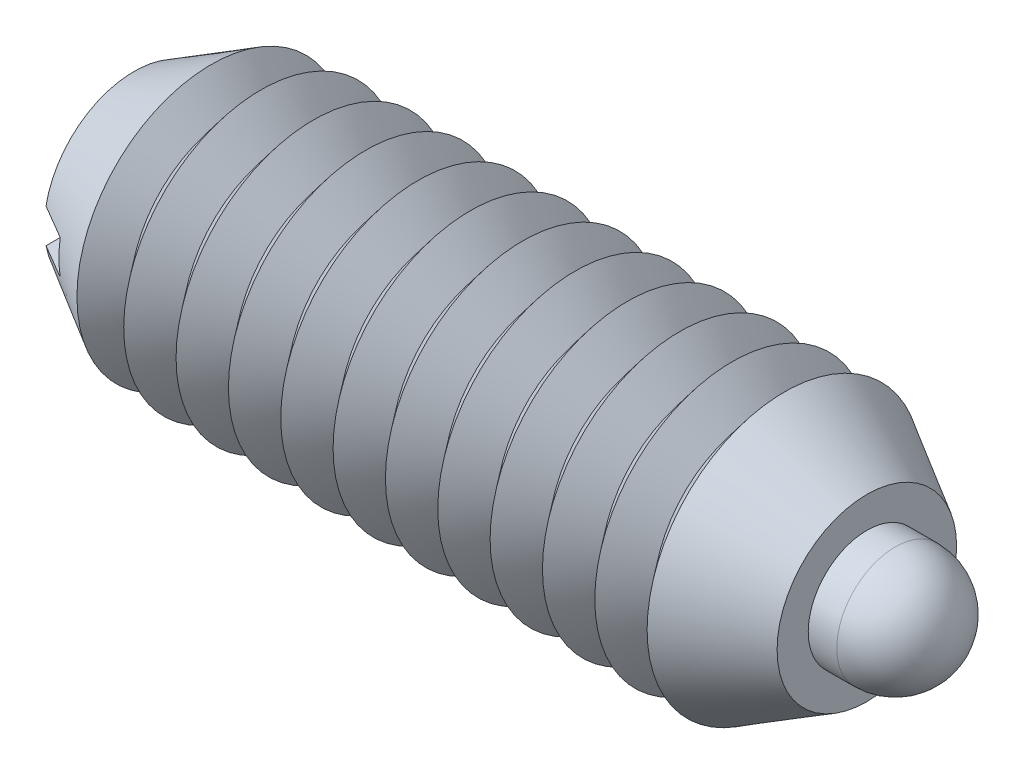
ISO-10303-21;
HEADER;
FILE_DESCRIPTION(('STEP AP214'),'2;1');
FILE_NAME('part.step','',(''),(''),'','','');
FILE_SCHEMA(('AUTOMOTIVE_DESIGN { 1 0 10303 214 1 1 1 1 }'));
ENDSEC;
DATA;
#1=APPLICATION_CONTEXT('core data for automotive mechanical design processes');
#2=APPLICATION_PROTOCOL_DEFINITION('international standard','automotive_design',2000,#1);
#3=PRODUCT_CONTEXT('',#1,'mechanical');
#4=PRODUCT('Part','Part','',(#3));
#5=PRODUCT_RELATED_PRODUCT_CATEGORY('part','',(#4));
#6=PRODUCT_DEFINITION_FORMATION('','',#4);
#7=PRODUCT_DEFINITION_CONTEXT('part definition',#1,'design');
#8=PRODUCT_DEFINITION('design','',#6,#7);
#9=PRODUCT_DEFINITION_SHAPE('','',#8);
#10=(LENGTH_UNIT() NAMED_UNIT(*) SI_UNIT(.MILLI.,.METRE.));
#11=(NAMED_UNIT(*) PLANE_ANGLE_UNIT() SI_UNIT($,.RADIAN.));
#12=(NAMED_UNIT(*) SI_UNIT($,.STERADIAN.) SOLID_ANGLE_UNIT());
#13=UNCERTAINTY_MEASURE_WITH_UNIT(LENGTH_MEASURE(1.E-05),#10,'distance_accuracy_value','');
#14=(GEOMETRIC_REPRESENTATION_CONTEXT(3) GLOBAL_UNCERTAINTY_ASSIGNED_CONTEXT((#13)) GLOBAL_UNIT_ASSIGNED_CONTEXT((#10,
#11,#12)) REPRESENTATION_CONTEXT('',''));
#15=CARTESIAN_POINT('',(0.,0.,0.));
#16=DIRECTION('',(0.,0.,1.));
#17=DIRECTION('',(1.,0.,0.));
#18=AXIS2_PLACEMENT_3D('',#15,#16,#17);
#19=CARTESIAN_POINT('',(9.0678,0.,0.));
#20=DIRECTION('',(-1.,0.,0.));
#21=DIRECTION('',(0.,-0.719424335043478,-0.694570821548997));
#22=AXIS2_PLACEMENT_3D('',#19,#20,#21);
#23=PLANE('',#22);
#24=CARTESIAN_POINT('',(9.0678,0.,0.));
#25=DIRECTION('',(1.,0.,0.));
#26=DIRECTION('',(0.,0.719424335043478,0.694570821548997));
#27=AXIS2_PLACEMENT_3D('',#24,#25,#26);
#28=CIRCLE('',#27,0.889);
#29=CARTESIAN_POINT('',(9.0678,0.639568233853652,0.617473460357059));
#30=VERTEX_POINT('',#29);
#31=EDGE_CURVE('P0_E10',#30,#30,#28,.T.);
#32=ORIENTED_EDGE('',*,*,#31,.F.);
#33=EDGE_LOOP('',(#32));
#34=FACE_BOUND('',#33,.T.);
#35=ADVANCED_FACE('P0_F14',(#34),#23,.T.);
#36=CARTESIAN_POINT('',(9.2456,0.,0.));
#37=DIRECTION('',(1.,0.,0.));
#38=DIRECTION('',(0.,0.719424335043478,0.694570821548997));
#39=AXIS2_PLACEMENT_3D('',#36,#37,#38);
#40=CONICAL_SURFACE('',#39,1.0668,0.78539816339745);
#41=ORIENTED_EDGE('',*,*,#31,.T.);
#42=EDGE_LOOP('',(#41));
#43=FACE_BOUND('',#42,.T.);
#44=CARTESIAN_POINT('',(9.2456,0.,0.));
#45=DIRECTION('',(1.,0.,0.));
#46=DIRECTION('',(0.,0.719424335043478,0.694570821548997));
#47=AXIS2_PLACEMENT_3D('',#44,#45,#46);
#48=CIRCLE('',#47,1.0668);
#49=CARTESIAN_POINT('',(9.2456,0.767481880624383,0.740968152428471));
#50=VERTEX_POINT('',#49);
#51=EDGE_CURVE('P0_E20',#50,#50,#48,.T.);
#52=ORIENTED_EDGE('',*,*,#51,.F.);
#53=EDGE_LOOP('',(#52));
#54=FACE_BOUND('',#53,.T.);
#55=ADVANCED_FACE('P0_F54',(#43,#54),#40,.T.);
#56=CARTESIAN_POINT('',(12.4333,0.,0.));
#57=DIRECTION('',(1.,0.,0.));
#58=DIRECTION('',(0.,0.719424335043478,0.694570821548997));
#59=AXIS2_PLACEMENT_3D('',#56,#57,#58);
#60=CYLINDRICAL_SURFACE('',#59,1.0668);
#61=ORIENTED_EDGE('',*,*,#51,.T.);
#62=EDGE_LOOP('',(#61));
#63=FACE_BOUND('',#62,.T.);
#64=CARTESIAN_POINT('',(10.5378413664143,0.,0.));
#65=DIRECTION('',(1.,0.,0.));
#66=DIRECTION('',(0.,0.719424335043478,0.694570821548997));
#67=AXIS2_PLACEMENT_3D('',#64,#65,#66);
#68=CIRCLE('',#67,1.0668);
#69=CARTESIAN_POINT('',(10.5378413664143,0.767481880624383,0.74096815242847));
#70=VERTEX_POINT('',#69);
#71=EDGE_CURVE('P0_E24',#70,#70,#68,.T.);
#72=ORIENTED_EDGE('',*,*,#71,.F.);
#73=EDGE_LOOP('',(#72));
#74=FACE_BOUND('',#73,.T.);
#75=ADVANCED_FACE('P0_F50',(#63,#74),#60,.T.);
#76=CARTESIAN_POINT('',(10.8458,0.,0.));
#77=DIRECTION('',(-1.,0.,0.));
#78=DIRECTION('',(0.,-0.719424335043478,-0.694570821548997));
#79=AXIS2_PLACEMENT_3D('',#76,#77,#78);
#80=CONICAL_SURFACE('',#79,0.889,0.523598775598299);
#81=ORIENTED_EDGE('',*,*,#71,.T.);
#82=EDGE_LOOP('',(#81));
#83=FACE_BOUND('',#82,.T.);
#84=CARTESIAN_POINT('',(10.8458,0.,0.));
#85=DIRECTION('',(1.,0.,0.));
#86=DIRECTION('',(0.,0.719424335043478,0.694570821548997));
#87=AXIS2_PLACEMENT_3D('',#84,#85,#86);
#88=CIRCLE('',#87,0.889);
#89=CARTESIAN_POINT('',(10.8458,0.639568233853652,0.617473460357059));
#90=VERTEX_POINT('',#89);
#91=EDGE_CURVE('P0_E28',#90,#90,#88,.T.);
#92=ORIENTED_EDGE('',*,*,#91,.F.);
#93=EDGE_LOOP('',(#92));
#94=FACE_BOUND('',#93,.T.);
#95=ADVANCED_FACE('P0_F41',(#83,#94),#80,.T.);
#96=CARTESIAN_POINT('',(12.4333,0.,0.));
#97=DIRECTION('',(1.,0.,0.));
#98=DIRECTION('',(0.,0.719424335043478,0.694570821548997));
#99=AXIS2_PLACEMENT_3D('',#96,#97,#98);
#100=CYLINDRICAL_SURFACE('',#99,0.889);
#101=ORIENTED_EDGE('',*,*,#91,.T.);
#102=EDGE_LOOP('',(#101));
#103=FACE_BOUND('',#102,.T.);
#104=CARTESIAN_POINT('',(11.5443,0.,0.));
#105=DIRECTION('',(1.,0.,0.));
#106=DIRECTION('',(0.,0.719424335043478,0.694570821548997));
#107=AXIS2_PLACEMENT_3D('',#104,#105,#106);
#108=CIRCLE('',#107,0.889);
#109=CARTESIAN_POINT('',(11.5443,0.639568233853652,0.617473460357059));
#110=VERTEX_POINT('',#109);
#111=EDGE_CURVE('P0_E33',#110,#110,#108,.T.);
#112=ORIENTED_EDGE('',*,*,#111,.F.);
#113=EDGE_LOOP('',(#112));
#114=FACE_BOUND('',#113,.T.);
#115=ADVANCED_FACE('P0_F39',(#103,#114),#100,.T.);
#116=CARTESIAN_POINT('',(11.5443,0.,0.));
#117=DIRECTION('',(1.,0.,0.));
#118=DIRECTION('',(0.,-0.719424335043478,-0.694570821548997));
#119=AXIS2_PLACEMENT_3D('',#116,#117,#118);
#120=SPHERICAL_SURFACE('',#119,0.889);
#121=ORIENTED_EDGE('',*,*,#111,.T.);
#122=EDGE_LOOP('',(#121));
#123=FACE_BOUND('',#122,.T.);
#124=ADVANCED_FACE('P0_F37',(#123),#120,.T.);
#125=CLOSED_SHELL('',(#35,#55,#75,#95,#115,#124));
#126=MANIFOLD_SOLID_BREP('P0_B1',#125);
#127=CARTESIAN_POINT('',(11.1125,0.,0.));
#128=DIRECTION('',(1.,0.,0.));
#129=DIRECTION('',(0.,0.,-1.));
#130=AXIS2_PLACEMENT_3D('',#127,#128,#129);
#131=PLANE('',#130);
#132=CARTESIAN_POINT('',(11.1125,0.,0.));
#133=DIRECTION('',(1.,0.,0.));
#134=DIRECTION('',(0.,0.,-1.));
#135=AXIS2_PLACEMENT_3D('',#132,#133,#134);
#136=CIRCLE('',#135,1.36129691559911);
#137=CARTESIAN_POINT('',(11.1125,0.,-1.36129691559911));
#138=VERTEX_POINT('',#137);
#139=EDGE_CURVE('P1_E78',#138,#138,#136,.T.);
#140=ORIENTED_EDGE('',*,*,#139,.T.);
#141=EDGE_LOOP('',(#140));
#142=FACE_BOUND('',#141,.T.);
#143=CARTESIAN_POINT('',(11.1125,0.,0.));
#144=DIRECTION('',(-1.,0.,0.));
#145=DIRECTION('',(0.,0.,1.));
#146=AXIS2_PLACEMENT_3D('',#143,#144,#145);
#147=CIRCLE('',#146,0.889);
#148=CARTESIAN_POINT('',(11.1125,0.,0.889));
#149=VERTEX_POINT('',#148);
#150=EDGE_CURVE('P1_E65',#149,#149,#147,.T.);
#151=ORIENTED_EDGE('',*,*,#150,.T.);
#152=EDGE_LOOP('',(#151));
#153=FACE_BOUND('',#152,.T.);
#154=ADVANCED_FACE('P1_F15',(#142,#153),#131,.T.);
#155=CARTESIAN_POINT('',(11.1125,0.,0.));
#156=DIRECTION('',(-1.,0.,0.));
#157=DIRECTION('',(0.,0.,1.));
#158=AXIS2_PLACEMENT_3D('',#155,#156,#157);
#159=CONICAL_SURFACE('',#158,1.36129691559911,0.523598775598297);
#160=CARTESIAN_POINT('',(9.86281999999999,0.,0.));
#161=DIRECTION('',(-1.,0.,0.));
#162=DIRECTION('',(0.,0.,1.));
#163=AXIS2_PLACEMENT_3D('',#160,#161,#162);
#164=CIRCLE('',#163,2.0828);
#165=CARTESIAN_POINT('',(9.86281999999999,0.,2.0828));
#166=VERTEX_POINT('',#165);
#167=EDGE_CURVE('P1_E127',#166,#166,#164,.T.);
#168=ORIENTED_EDGE('',*,*,#167,.F.);
#169=EDGE_LOOP('',(#168));
#170=FACE_BOUND('',#169,.T.);
#171=ORIENTED_EDGE('',*,*,#139,.F.);
#172=EDGE_LOOP('',(#171));
#173=FACE_BOUND('',#172,.T.);
#174=ADVANCED_FACE('P1_F17',(#170,#173),#159,.T.);
#175=CARTESIAN_POINT('',(0.,0.,0.));
#176=DIRECTION('',(-1.,0.,0.));
#177=DIRECTION('',(0.,0.,1.));
#178=AXIS2_PLACEMENT_3D('',#175,#176,#177);
#179=CYLINDRICAL_SURFACE('',#178,0.889);
#180=CARTESIAN_POINT('',(10.8458,0.,0.));
#181=DIRECTION('',(-1.,0.,0.));
#182=DIRECTION('',(0.,0.,1.));
#183=AXIS2_PLACEMENT_3D('',#180,#181,#182);
#184=CIRCLE('',#183,0.889);
#185=CARTESIAN_POINT('',(10.8458,0.,0.889));
#186=VERTEX_POINT('',#185);
#187=EDGE_CURVE('P1_E115',#186,#186,#184,.T.);
#188=ORIENTED_EDGE('',*,*,#187,.T.);
#189=EDGE_LOOP('',(#188));
#190=FACE_BOUND('',#189,.T.);
#191=ORIENTED_EDGE('',*,*,#150,.F.);
#192=EDGE_LOOP('',(#191));
#193=FACE_BOUND('',#192,.T.);
#194=ADVANCED_FACE('P1_F214',(#190,#193),#179,.F.);
#195=CARTESIAN_POINT('',(10.8458,0.,0.));
#196=DIRECTION('',(-1.,0.,0.));
#197=DIRECTION('',(0.,0.,1.));
#198=AXIS2_PLACEMENT_3D('',#195,#196,#197);
#199=CONICAL_SURFACE('',#198,0.889,0.78539816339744);
#200=CARTESIAN_POINT('',(10.668,0.,0.));
#201=DIRECTION('',(-1.,0.,0.));
#202=DIRECTION('',(0.,0.,1.));
#203=AXIS2_PLACEMENT_3D('',#200,#201,#202);
#204=CIRCLE('',#203,1.0668);
#205=CARTESIAN_POINT('',(10.668,0.,1.0668));
#206=VERTEX_POINT('',#205);
#207=EDGE_CURVE('P1_E118',#206,#206,#204,.T.);
#208=ORIENTED_EDGE('',*,*,#207,.T.);
#209=EDGE_LOOP('',(#208));
#210=FACE_BOUND('',#209,.T.);
#211=ORIENTED_EDGE('',*,*,#187,.F.);
#212=EDGE_LOOP('',(#211));
#213=FACE_BOUND('',#212,.T.);
#214=ADVANCED_FACE('P1_F221',(#210,#213),#199,.F.);
#215=CARTESIAN_POINT('',(0.,0.,0.));
#216=DIRECTION('',(-1.,0.,0.));
#217=DIRECTION('',(0.,0.,1.));
#218=AXIS2_PLACEMENT_3D('',#215,#216,#217);
#219=CYLINDRICAL_SURFACE('',#218,1.0668);
#220=CARTESIAN_POINT('',(1.5621,0.,0.));
#221=DIRECTION('',(-1.,0.,0.));
#222=DIRECTION('',(0.,0.,1.));
#223=AXIS2_PLACEMENT_3D('',#220,#221,#222);
#224=CIRCLE('',#223,1.0668);
#225=CARTESIAN_POINT('',(1.5621,0.,1.0668));
#226=VERTEX_POINT('',#225);
#227=EDGE_CURVE('P1_E121',#226,#226,#224,.T.);
#228=ORIENTED_EDGE('',*,*,#227,.T.);
#229=EDGE_LOOP('',(#228));
#230=FACE_BOUND('',#229,.T.);
#231=ORIENTED_EDGE('',*,*,#207,.F.);
#232=EDGE_LOOP('',(#231));
#233=FACE_BOUND('',#232,.T.);
#234=ADVANCED_FACE('P1_F226',(#230,#233),#219,.F.);
#235=CARTESIAN_POINT('',(1.5621,0.,0.));
#236=DIRECTION('',(1.,0.,0.));
#237=DIRECTION('',(0.,0.,-1.));
#238=AXIS2_PLACEMENT_3D('',#235,#236,#237);
#239=PLANE('',#238);
#240=ORIENTED_EDGE('',*,*,#227,.F.);
#241=EDGE_LOOP('',(#240));
#242=FACE_BOUND('',#241,.T.);
#243=ADVANCED_FACE('P1_F232',(#242),#239,.T.);
#244=CARTESIAN_POINT('',(9.46594499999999,0.,0.));
#245=DIRECTION('',(1.,0.,0.));
#246=DIRECTION('',(0.,0.,-1.));
#247=AXIS2_PLACEMENT_3D('',#244,#245,#246);
#248=CONICAL_SURFACE('',#247,1.58710328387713,0.895664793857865);
#249=ORIENTED_EDGE('',*,*,#167,.T.);
#250=EDGE_LOOP('',(#249));
#251=FACE_BOUND('',#250,.T.);
#252=CARTESIAN_POINT('',(9.46594499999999,0.,0.));
#253=DIRECTION('',(-1.,0.,0.));
#254=DIRECTION('',(0.,0.,1.));
#255=AXIS2_PLACEMENT_3D('',#252,#253,#254);
#256=CIRCLE('',#255,1.58710328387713);
#257=CARTESIAN_POINT('',(9.46594499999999,0.,1.58710328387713));
#258=VERTEX_POINT('',#257);
#259=EDGE_CURVE('P1_E124',#258,#258,#256,.T.);
#260=ORIENTED_EDGE('',*,*,#259,.F.);
#261=EDGE_LOOP('',(#260));
#262=FACE_BOUND('',#261,.T.);
#263=ADVANCED_FACE('P1_F236',(#251,#262),#248,.T.);
#264=CARTESIAN_POINT('',(9.06906999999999,0.,0.));
#265=DIRECTION('',(-1.,0.,0.));
#266=DIRECTION('',(0.,0.,1.));
#267=AXIS2_PLACEMENT_3D('',#264,#265,#266);
#268=CONICAL_SURFACE('',#267,2.0828,0.895664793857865);
#269=ORIENTED_EDGE('',*,*,#259,.T.);
#270=EDGE_LOOP('',(#269));
#271=FACE_BOUND('',#270,.T.);
#272=CARTESIAN_POINT('',(9.06906999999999,0.,0.));
#273=DIRECTION('',(-1.,0.,0.));
#274=DIRECTION('',(0.,0.,1.));
#275=AXIS2_PLACEMENT_3D('',#272,#273,#274);
#276=CIRCLE('',#275,2.0828);
#277=CARTESIAN_POINT('',(9.06906999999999,0.,2.0828));
#278=VERTEX_POINT('',#277);
#279=EDGE_CURVE('P1_E133',#278,#278,#276,.T.);
#280=ORIENTED_EDGE('',*,*,#279,.F.);
#281=EDGE_LOOP('',(#280));
#282=FACE_BOUND('',#281,.T.);
#283=ADVANCED_FACE('P1_F240',(#271,#282),#268,.T.);
#284=CARTESIAN_POINT('',(8.67219499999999,0.,0.));
#285=DIRECTION('',(1.,0.,0.));
#286=DIRECTION('',(0.,0.,-1.));
#287=AXIS2_PLACEMENT_3D('',#284,#285,#286);
#288=CONICAL_SURFACE('',#287,1.58710328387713,0.895664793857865);
#289=ORIENTED_EDGE('',*,*,#279,.T.);
#290=EDGE_LOOP('',(#289));
#291=FACE_BOUND('',#290,.T.);
#292=CARTESIAN_POINT('',(8.67219499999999,0.,0.));
#293=DIRECTION('',(-1.,0.,0.));
#294=DIRECTION('',(0.,0.,1.));
#295=AXIS2_PLACEMENT_3D('',#292,#293,#294);
#296=CIRCLE('',#295,1.58710328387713);
#297=CARTESIAN_POINT('',(8.67219499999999,0.,1.58710328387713));
#298=VERTEX_POINT('',#297);
#299=EDGE_CURVE('P1_E130',#298,#298,#296,.T.);
#300=ORIENTED_EDGE('',*,*,#299,.F.);
#301=EDGE_LOOP('',(#300));
#302=FACE_BOUND('',#301,.T.);
#303=ADVANCED_FACE('P1_F244',(#291,#302),#288,.T.);
#304=CARTESIAN_POINT('',(8.27532,0.,0.));
#305=DIRECTION('',(-1.,0.,0.));
#306=DIRECTION('',(0.,0.,1.));
#307=AXIS2_PLACEMENT_3D('',#304,#305,#306);
#308=CONICAL_SURFACE('',#307,2.0828,0.895664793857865);
#309=ORIENTED_EDGE('',*,*,#299,.T.);
#310=EDGE_LOOP('',(#309));
#311=FACE_BOUND('',#310,.T.);
#312=CARTESIAN_POINT('',(8.27531999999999,0.,0.));
#313=DIRECTION('',(-1.,0.,0.));
#314=DIRECTION('',(0.,0.,1.));
#315=AXIS2_PLACEMENT_3D('',#312,#313,#314);
#316=CIRCLE('',#315,2.0828);
#317=CARTESIAN_POINT('',(8.27531999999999,0.,2.0828));
#318=VERTEX_POINT('',#317);
#319=EDGE_CURVE('P1_E139',#318,#318,#316,.T.);
#320=ORIENTED_EDGE('',*,*,#319,.F.);
#321=EDGE_LOOP('',(#320));
#322=FACE_BOUND('',#321,.T.);
#323=ADVANCED_FACE('P1_F248',(#311,#322),#308,.T.);
#324=CARTESIAN_POINT('',(7.87844499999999,0.,0.));
#325=DIRECTION('',(1.,0.,0.));
#326=DIRECTION('',(0.,0.,-1.));
#327=AXIS2_PLACEMENT_3D('',#324,#325,#326);
#328=CONICAL_SURFACE('',#327,1.58710328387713,0.895664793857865);
#329=ORIENTED_EDGE('',*,*,#319,.T.);
#330=EDGE_LOOP('',(#329));
#331=FACE_BOUND('',#330,.T.);
#332=CARTESIAN_POINT('',(7.87844499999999,0.,0.));
#333=DIRECTION('',(-1.,0.,0.));
#334=DIRECTION('',(0.,0.,1.));
#335=AXIS2_PLACEMENT_3D('',#332,#333,#334);
#336=CIRCLE('',#335,1.58710328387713);
#337=CARTESIAN_POINT('',(7.87844499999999,0.,1.58710328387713));
#338=VERTEX_POINT('',#337);
#339=EDGE_CURVE('P1_E136',#338,#338,#336,.T.);
#340=ORIENTED_EDGE('',*,*,#339,.F.);
#341=EDGE_LOOP('',(#340));
#342=FACE_BOUND('',#341,.T.);
#343=ADVANCED_FACE('P1_F252',(#331,#342),#328,.T.);
#344=CARTESIAN_POINT('',(7.48156999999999,0.,0.));
#345=DIRECTION('',(-1.,0.,0.));
#346=DIRECTION('',(0.,0.,1.));
#347=AXIS2_PLACEMENT_3D('',#344,#345,#346);
#348=CONICAL_SURFACE('',#347,2.0828,0.895664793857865);
#349=ORIENTED_EDGE('',*,*,#339,.T.);
#350=EDGE_LOOP('',(#349));
#351=FACE_BOUND('',#350,.T.);
#352=CARTESIAN_POINT('',(7.48156999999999,0.,0.));
#353=DIRECTION('',(-1.,0.,0.));
#354=DIRECTION('',(0.,0.,1.));
#355=AXIS2_PLACEMENT_3D('',#352,#353,#354);
#356=CIRCLE('',#355,2.0828);
#357=CARTESIAN_POINT('',(7.48156999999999,0.,2.0828));
#358=VERTEX_POINT('',#357);
#359=EDGE_CURVE('P1_E145',#358,#358,#356,.T.);
#360=ORIENTED_EDGE('',*,*,#359,.F.);
#361=EDGE_LOOP('',(#360));
#362=FACE_BOUND('',#361,.T.);
#363=ADVANCED_FACE('P1_F256',(#351,#362),#348,.T.);
#364=CARTESIAN_POINT('',(7.08469499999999,0.,0.));
#365=DIRECTION('',(1.,0.,0.));
#366=DIRECTION('',(0.,0.,-1.));
#367=AXIS2_PLACEMENT_3D('',#364,#365,#366);
#368=CONICAL_SURFACE('',#367,1.58710328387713,0.895664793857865);
#369=ORIENTED_EDGE('',*,*,#359,.T.);
#370=EDGE_LOOP('',(#369));
#371=FACE_BOUND('',#370,.T.);
#372=CARTESIAN_POINT('',(7.08469499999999,0.,0.));
#373=DIRECTION('',(-1.,0.,0.));
#374=DIRECTION('',(0.,0.,1.));
#375=AXIS2_PLACEMENT_3D('',#372,#373,#374);
#376=CIRCLE('',#375,1.58710328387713);
#377=CARTESIAN_POINT('',(7.08469499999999,0.,1.58710328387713));
#378=VERTEX_POINT('',#377);
#379=EDGE_CURVE('P1_E142',#378,#378,#376,.T.);
#380=ORIENTED_EDGE('',*,*,#379,.F.);
#381=EDGE_LOOP('',(#380));
#382=FACE_BOUND('',#381,.T.);
#383=ADVANCED_FACE('P1_F260',(#371,#382),#368,.T.);
#384=CARTESIAN_POINT('',(6.68781999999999,0.,0.));
#385=DIRECTION('',(-1.,0.,0.));
#386=DIRECTION('',(0.,0.,1.));
#387=AXIS2_PLACEMENT_3D('',#384,#385,#386);
#388=CONICAL_SURFACE('',#387,2.0828,0.895664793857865);
#389=ORIENTED_EDGE('',*,*,#379,.T.);
#390=EDGE_LOOP('',(#389));
#391=FACE_BOUND('',#390,.T.);
#392=CARTESIAN_POINT('',(6.68781999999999,0.,0.));
#393=DIRECTION('',(-1.,0.,0.));
#394=DIRECTION('',(0.,0.,1.));
#395=AXIS2_PLACEMENT_3D('',#392,#393,#394);
#396=CIRCLE('',#395,2.0828);
#397=CARTESIAN_POINT('',(6.68781999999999,0.,2.0828));
#398=VERTEX_POINT('',#397);
#399=EDGE_CURVE('P1_E151',#398,#398,#396,.T.);
#400=ORIENTED_EDGE('',*,*,#399,.F.);
#401=EDGE_LOOP('',(#400));
#402=FACE_BOUND('',#401,.T.);
#403=ADVANCED_FACE('P1_F264',(#391,#402),#388,.T.);
#404=CARTESIAN_POINT('',(6.29094499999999,0.,0.));
#405=DIRECTION('',(1.,0.,0.));
#406=DIRECTION('',(0.,0.,-1.));
#407=AXIS2_PLACEMENT_3D('',#404,#405,#406);
#408=CONICAL_SURFACE('',#407,1.58710328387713,0.895664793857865);
#409=ORIENTED_EDGE('',*,*,#399,.T.);
#410=EDGE_LOOP('',(#409));
#411=FACE_BOUND('',#410,.T.);
#412=CARTESIAN_POINT('',(6.29094499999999,0.,0.));
#413=DIRECTION('',(-1.,0.,0.));
#414=DIRECTION('',(0.,0.,1.));
#415=AXIS2_PLACEMENT_3D('',#412,#413,#414);
#416=CIRCLE('',#415,1.58710328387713);
#417=CARTESIAN_POINT('',(6.29094499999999,0.,1.58710328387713));
#418=VERTEX_POINT('',#417);
#419=EDGE_CURVE('P1_E148',#418,#418,#416,.T.);
#420=ORIENTED_EDGE('',*,*,#419,.F.);
#421=EDGE_LOOP('',(#420));
#422=FACE_BOUND('',#421,.T.);
#423=ADVANCED_FACE('P1_F268',(#411,#422),#408,.T.);
#424=CARTESIAN_POINT('',(5.89406999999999,0.,0.));
#425=DIRECTION('',(-1.,0.,0.));
#426=DIRECTION('',(0.,0.,1.));
#427=AXIS2_PLACEMENT_3D('',#424,#425,#426);
#428=CONICAL_SURFACE('',#427,2.0828,0.895664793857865);
#429=ORIENTED_EDGE('',*,*,#419,.T.);
#430=EDGE_LOOP('',(#429));
#431=FACE_BOUND('',#430,.T.);
#432=CARTESIAN_POINT('',(5.89406999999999,0.,0.));
#433=DIRECTION('',(-1.,0.,0.));
#434=DIRECTION('',(0.,0.,1.));
#435=AXIS2_PLACEMENT_3D('',#432,#433,#434);
#436=CIRCLE('',#435,2.0828);
#437=CARTESIAN_POINT('',(5.89406999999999,0.,2.0828));
#438=VERTEX_POINT('',#437);
#439=EDGE_CURVE('P1_E157',#438,#438,#436,.T.);
#440=ORIENTED_EDGE('',*,*,#439,.F.);
#441=EDGE_LOOP('',(#440));
#442=FACE_BOUND('',#441,.T.);
#443=ADVANCED_FACE('P1_F272',(#431,#442),#428,.T.);
#444=CARTESIAN_POINT('',(5.49719499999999,0.,0.));
#445=DIRECTION('',(1.,0.,0.));
#446=DIRECTION('',(0.,0.,-1.));
#447=AXIS2_PLACEMENT_3D('',#444,#445,#446);
#448=CONICAL_SURFACE('',#447,1.58710328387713,0.895664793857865);
#449=ORIENTED_EDGE('',*,*,#439,.T.);
#450=EDGE_LOOP('',(#449));
#451=FACE_BOUND('',#450,.T.);
#452=CARTESIAN_POINT('',(5.49719499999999,0.,0.));
#453=DIRECTION('',(-1.,0.,0.));
#454=DIRECTION('',(0.,0.,1.));
#455=AXIS2_PLACEMENT_3D('',#452,#453,#454);
#456=CIRCLE('',#455,1.58710328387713);
#457=CARTESIAN_POINT('',(5.49719499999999,0.,1.58710328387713));
#458=VERTEX_POINT('',#457);
#459=EDGE_CURVE('P1_E154',#458,#458,#456,.T.);
#460=ORIENTED_EDGE('',*,*,#459,.F.);
#461=EDGE_LOOP('',(#460));
#462=FACE_BOUND('',#461,.T.);
#463=ADVANCED_FACE('P1_F276',(#451,#462),#448,.T.);
#464=CARTESIAN_POINT('',(5.10031999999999,0.,0.));
#465=DIRECTION('',(-1.,0.,0.));
#466=DIRECTION('',(0.,0.,1.));
#467=AXIS2_PLACEMENT_3D('',#464,#465,#466);
#468=CONICAL_SURFACE('',#467,2.0828,0.895664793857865);
#469=ORIENTED_EDGE('',*,*,#459,.T.);
#470=EDGE_LOOP('',(#469));
#471=FACE_BOUND('',#470,.T.);
#472=CARTESIAN_POINT('',(5.10031999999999,0.,0.));
#473=DIRECTION('',(-1.,0.,0.));
#474=DIRECTION('',(0.,0.,1.));
#475=AXIS2_PLACEMENT_3D('',#472,#473,#474);
#476=CIRCLE('',#475,2.0828);
#477=CARTESIAN_POINT('',(5.10031999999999,0.,2.0828));
#478=VERTEX_POINT('',#477);
#479=EDGE_CURVE('P1_E163',#478,#478,#476,.T.);
#480=ORIENTED_EDGE('',*,*,#479,.F.);
#481=EDGE_LOOP('',(#480));
#482=FACE_BOUND('',#481,.T.);
#483=ADVANCED_FACE('P1_F280',(#471,#482),#468,.T.);
#484=CARTESIAN_POINT('',(4.70344499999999,0.,0.));
#485=DIRECTION('',(1.,0.,0.));
#486=DIRECTION('',(0.,0.,-1.));
#487=AXIS2_PLACEMENT_3D('',#484,#485,#486);
#488=CONICAL_SURFACE('',#487,1.58710328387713,0.895664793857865);
#489=ORIENTED_EDGE('',*,*,#479,.T.);
#490=EDGE_LOOP('',(#489));
#491=FACE_BOUND('',#490,.T.);
#492=CARTESIAN_POINT('',(4.70344499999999,0.,0.));
#493=DIRECTION('',(-1.,0.,0.));
#494=DIRECTION('',(0.,0.,1.));
#495=AXIS2_PLACEMENT_3D('',#492,#493,#494);
#496=CIRCLE('',#495,1.58710328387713);
#497=CARTESIAN_POINT('',(4.70344499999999,0.,1.58710328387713));
#498=VERTEX_POINT('',#497);
#499=EDGE_CURVE('P1_E160',#498,#498,#496,.T.);
#500=ORIENTED_EDGE('',*,*,#499,.F.);
#501=EDGE_LOOP('',(#500));
#502=FACE_BOUND('',#501,.T.);
#503=ADVANCED_FACE('P1_F284',(#491,#502),#488,.T.);
#504=CARTESIAN_POINT('',(4.30657,0.,0.));
#505=DIRECTION('',(-1.,0.,0.));
#506=DIRECTION('',(0.,0.,1.));
#507=AXIS2_PLACEMENT_3D('',#504,#505,#506);
#508=CONICAL_SURFACE('',#507,2.0828,0.895664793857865);
#509=ORIENTED_EDGE('',*,*,#499,.T.);
#510=EDGE_LOOP('',(#509));
#511=FACE_BOUND('',#510,.T.);
#512=CARTESIAN_POINT('',(4.30656999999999,0.,0.));
#513=DIRECTION('',(-1.,0.,0.));
#514=DIRECTION('',(0.,0.,1.));
#515=AXIS2_PLACEMENT_3D('',#512,#513,#514);
#516=CIRCLE('',#515,2.0828);
#517=CARTESIAN_POINT('',(4.30656999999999,0.,2.0828));
#518=VERTEX_POINT('',#517);
#519=EDGE_CURVE('P1_E169',#518,#518,#516,.T.);
#520=ORIENTED_EDGE('',*,*,#519,.F.);
#521=EDGE_LOOP('',(#520));
#522=FACE_BOUND('',#521,.T.);
#523=ADVANCED_FACE('P1_F288',(#511,#522),#508,.T.);
#524=CARTESIAN_POINT('',(3.909695,0.,0.));
#525=DIRECTION('',(1.,0.,0.));
#526=DIRECTION('',(0.,0.,-1.));
#527=AXIS2_PLACEMENT_3D('',#524,#525,#526);
#528=CONICAL_SURFACE('',#527,1.58710328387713,0.895664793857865);
#529=ORIENTED_EDGE('',*,*,#519,.T.);
#530=EDGE_LOOP('',(#529));
#531=FACE_BOUND('',#530,.T.);
#532=CARTESIAN_POINT('',(3.909695,0.,0.));
#533=DIRECTION('',(-1.,0.,0.));
#534=DIRECTION('',(0.,0.,1.));
#535=AXIS2_PLACEMENT_3D('',#532,#533,#534);
#536=CIRCLE('',#535,1.58710328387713);
#537=CARTESIAN_POINT('',(3.909695,0.,1.58710328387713));
#538=VERTEX_POINT('',#537);
#539=EDGE_CURVE('P1_E166',#538,#538,#536,.T.);
#540=ORIENTED_EDGE('',*,*,#539,.F.);
#541=EDGE_LOOP('',(#540));
#542=FACE_BOUND('',#541,.T.);
#543=ADVANCED_FACE('P1_F292',(#531,#542),#528,.T.);
#544=CARTESIAN_POINT('',(3.51282,0.,0.));
#545=DIRECTION('',(-1.,0.,0.));
#546=DIRECTION('',(0.,0.,1.));
#547=AXIS2_PLACEMENT_3D('',#544,#545,#546);
#548=CONICAL_SURFACE('',#547,2.0828,0.895664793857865);
#549=ORIENTED_EDGE('',*,*,#539,.T.);
#550=EDGE_LOOP('',(#549));
#551=FACE_BOUND('',#550,.T.);
#552=CARTESIAN_POINT('',(3.51281999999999,0.,0.));
#553=DIRECTION('',(-1.,0.,0.));
#554=DIRECTION('',(0.,0.,1.));
#555=AXIS2_PLACEMENT_3D('',#552,#553,#554);
#556=CIRCLE('',#555,2.0828);
#557=CARTESIAN_POINT('',(3.51281999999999,0.,2.0828));
#558=VERTEX_POINT('',#557);
#559=EDGE_CURVE('P1_E175',#558,#558,#556,.T.);
#560=ORIENTED_EDGE('',*,*,#559,.F.);
#561=EDGE_LOOP('',(#560));
#562=FACE_BOUND('',#561,.T.);
#563=ADVANCED_FACE('P1_F296',(#551,#562),#548,.T.);
#564=CARTESIAN_POINT('',(3.115945,0.,0.));
#565=DIRECTION('',(1.,0.,0.));
#566=DIRECTION('',(0.,0.,-1.));
#567=AXIS2_PLACEMENT_3D('',#564,#565,#566);
#568=CONICAL_SURFACE('',#567,1.58710328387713,0.895664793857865);
#569=ORIENTED_EDGE('',*,*,#559,.T.);
#570=EDGE_LOOP('',(#569));
#571=FACE_BOUND('',#570,.T.);
#572=CARTESIAN_POINT('',(3.115945,0.,0.));
#573=DIRECTION('',(-1.,0.,0.));
#574=DIRECTION('',(0.,0.,1.));
#575=AXIS2_PLACEMENT_3D('',#572,#573,#574);
#576=CIRCLE('',#575,1.58710328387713);
#577=CARTESIAN_POINT('',(3.115945,0.,1.58710328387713));
#578=VERTEX_POINT('',#577);
#579=EDGE_CURVE('P1_E172',#578,#578,#576,.T.);
#580=ORIENTED_EDGE('',*,*,#579,.F.);
#581=EDGE_LOOP('',(#580));
#582=FACE_BOUND('',#581,.T.);
#583=ADVANCED_FACE('P1_F300',(#571,#582),#568,.T.);
#584=CARTESIAN_POINT('',(2.71907,0.,0.));
#585=DIRECTION('',(-1.,0.,0.));
#586=DIRECTION('',(0.,0.,1.));
#587=AXIS2_PLACEMENT_3D('',#584,#585,#586);
#588=CONICAL_SURFACE('',#587,2.0828,0.895664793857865);
#589=ORIENTED_EDGE('',*,*,#579,.T.);
#590=EDGE_LOOP('',(#589));
#591=FACE_BOUND('',#590,.T.);
#592=CARTESIAN_POINT('',(2.71906999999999,0.,0.));
#593=DIRECTION('',(-1.,0.,0.));
#594=DIRECTION('',(0.,0.,1.));
#595=AXIS2_PLACEMENT_3D('',#592,#593,#594);
#596=CIRCLE('',#595,2.0828);
#597=CARTESIAN_POINT('',(2.71906999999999,0.,2.0828));
#598=VERTEX_POINT('',#597);
#599=EDGE_CURVE('P1_E181',#598,#598,#596,.T.);
#600=ORIENTED_EDGE('',*,*,#599,.F.);
#601=EDGE_LOOP('',(#600));
#602=FACE_BOUND('',#601,.T.);
#603=ADVANCED_FACE('P1_F206',(#591,#602),#588,.T.);
#604=CARTESIAN_POINT('',(2.32219499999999,0.,0.));
#605=DIRECTION('',(1.,0.,0.));
#606=DIRECTION('',(0.,0.,-1.));
#607=AXIS2_PLACEMENT_3D('',#604,#605,#606);
#608=CONICAL_SURFACE('',#607,1.58710328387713,0.895664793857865);
#609=ORIENTED_EDGE('',*,*,#599,.T.);
#610=EDGE_LOOP('',(#609));
#611=FACE_BOUND('',#610,.T.);
#612=CARTESIAN_POINT('',(2.32219499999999,0.,0.));
#613=DIRECTION('',(-1.,0.,0.));
#614=DIRECTION('',(0.,0.,1.));
#615=AXIS2_PLACEMENT_3D('',#612,#613,#614);
#616=CIRCLE('',#615,1.58710328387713);
#617=CARTESIAN_POINT('',(2.32219499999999,0.,1.58710328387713));
#618=VERTEX_POINT('',#617);
#619=EDGE_CURVE('P1_E178',#618,#618,#616,.T.);
#620=ORIENTED_EDGE('',*,*,#619,.F.);
#621=EDGE_LOOP('',(#620));
#622=FACE_BOUND('',#621,.T.);
#623=ADVANCED_FACE('P1_F196',(#611,#622),#608,.T.);
#624=CARTESIAN_POINT('',(1.92532,0.,0.));
#625=DIRECTION('',(-1.,0.,0.));
#626=DIRECTION('',(0.,0.,1.));
#627=AXIS2_PLACEMENT_3D('',#624,#625,#626);
#628=CONICAL_SURFACE('',#627,2.0828,0.895664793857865);
#629=ORIENTED_EDGE('',*,*,#619,.T.);
#630=EDGE_LOOP('',(#629));
#631=FACE_BOUND('',#630,.T.);
#632=CARTESIAN_POINT('',(1.92531999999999,0.,0.));
#633=DIRECTION('',(-1.,0.,0.));
#634=DIRECTION('',(0.,0.,1.));
#635=AXIS2_PLACEMENT_3D('',#632,#633,#634);
#636=CIRCLE('',#635,2.0828);
#637=CARTESIAN_POINT('',(1.92531999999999,0.,2.0828));
#638=VERTEX_POINT('',#637);
#639=EDGE_CURVE('P1_E187',#638,#638,#636,.T.);
#640=ORIENTED_EDGE('',*,*,#639,.F.);
#641=EDGE_LOOP('',(#640));
#642=FACE_BOUND('',#641,.T.);
#643=ADVANCED_FACE('P1_F194',(#631,#642),#628,.T.);
#644=CARTESIAN_POINT('',(1.52844499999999,0.,0.));
#645=DIRECTION('',(1.,0.,0.));
#646=DIRECTION('',(0.,0.,-1.));
#647=AXIS2_PLACEMENT_3D('',#644,#645,#646);
#648=CONICAL_SURFACE('',#647,1.58710328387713,0.895664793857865);
#649=ORIENTED_EDGE('',*,*,#639,.T.);
#650=EDGE_LOOP('',(#649));
#651=FACE_BOUND('',#650,.T.);
#652=CARTESIAN_POINT('',(1.52844499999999,0.,0.));
#653=DIRECTION('',(-1.,0.,0.));
#654=DIRECTION('',(0.,0.,1.));
#655=AXIS2_PLACEMENT_3D('',#652,#653,#654);
#656=CIRCLE('',#655,1.58710328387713);
#657=CARTESIAN_POINT('',(1.52844499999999,0.,1.58710328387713));
#658=VERTEX_POINT('',#657);
#659=EDGE_CURVE('P1_E184',#658,#658,#656,.T.);
#660=ORIENTED_EDGE('',*,*,#659,.F.);
#661=EDGE_LOOP('',(#660));
#662=FACE_BOUND('',#661,.T.);
#663=ADVANCED_FACE('P1_F191',(#651,#662),#648,.T.);
#664=CARTESIAN_POINT('',(1.13156999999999,0.,0.));
#665=DIRECTION('',(-1.,0.,0.));
#666=DIRECTION('',(0.,0.,1.));
#667=AXIS2_PLACEMENT_3D('',#664,#665,#666);
#668=CONICAL_SURFACE('',#667,2.0828,0.895664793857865);
#669=CARTESIAN_POINT('',(1.1689072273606,0.,0.));
#670=DIRECTION('',(-1.,0.,0.));
#671=DIRECTION('',(0.,0.,1.));
#672=AXIS2_PLACEMENT_3D('',#669,#670,#671);
#673=CIRCLE('',#672,2.03616581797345);
#674=CARTESIAN_POINT('',(1.1689072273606,0.,2.03616581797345));
#675=VERTEX_POINT('',#674);
#676=EDGE_CURVE('P1_E19',#675,#675,#673,.T.);
#677=ORIENTED_EDGE('',*,*,#676,.F.);
#678=EDGE_LOOP('',(#677));
#679=FACE_BOUND('',#678,.T.);
#680=ORIENTED_EDGE('',*,*,#659,.T.);
#681=EDGE_LOOP('',(#680));
#682=FACE_BOUND('',#681,.T.);
#683=ADVANCED_FACE('P1_F204',(#679,#682),#668,.T.);
#684=CARTESIAN_POINT('',(0.,0.,0.));
#685=DIRECTION('',(1.,0.,0.));
#686=DIRECTION('',(0.,0.,-1.));
#687=AXIS2_PLACEMENT_3D('',#684,#685,#686);
#688=PLANE('',#687);
#689=CARTESIAN_POINT('',(0.,0.,0.));
#690=DIRECTION('',(1.,0.,0.));
#691=DIRECTION('',(0.,0.,-1.));
#692=AXIS2_PLACEMENT_3D('',#689,#690,#691);
#693=CIRCLE('',#692,1.36129691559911);
#694=CARTESIAN_POINT('',(0.,-0.26035,-1.33616884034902));
#695=VERTEX_POINT('',#694);
#696=CARTESIAN_POINT('',(0.,-0.26035,1.33616884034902));
#697=VERTEX_POINT('',#696);
#698=EDGE_CURVE('P1_E74',#695,#697,#693,.F.);
#699=ORIENTED_EDGE('',*,*,#698,.T.);
#700=DIRECTION('',(0.,0.,1.));
#701=VECTOR('',#700,1.);
#702=CARTESIAN_POINT('',(0.,-0.26035,-2.0828));
#703=LINE('',#702,#701);
#704=EDGE_CURVE('P1_E32',#695,#697,#703,.T.);
#705=ORIENTED_EDGE('',*,*,#704,.F.);
#706=EDGE_LOOP('',(#699,#705));
#707=FACE_BOUND('',#706,.T.);
#708=ADVANCED_FACE('P1_F100',(#707),#688,.F.);
#709=CARTESIAN_POINT('',(0.,-0.26035,-2.0828));
#710=DIRECTION('',(0.,-1.,0.));
#711=DIRECTION('',(0.,0.,-1.));
#712=AXIS2_PLACEMENT_3D('',#709,#710,#711);
#713=PLANE('',#712);
#714=CARTESIAN_POINT('',(3.03971056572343,-0.26035,-3.10538007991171));
#715=CARTESIAN_POINT('',(2.73619356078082,-0.26035,-2.9295030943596));
#716=CARTESIAN_POINT('',(2.43269972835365,-0.26035,-2.75358610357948));
#717=CARTESIAN_POINT('',(1.82581746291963,-0.26035,-2.40143298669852));
#718=CARTESIAN_POINT('',(1.52242906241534,-0.26035,-2.22519680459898));
#719=CARTESIAN_POINT('',(0.923841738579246,-0.26035,-1.87683600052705));
#720=CARTESIAN_POINT('',(0.628635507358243,-0.26035,-1.70472396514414));
#721=CARTESIAN_POINT('',(0.186359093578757,-0.26035,-1.44570325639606));
#722=CARTESIAN_POINT('',(0.0390349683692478,-0.26035,-1.35922831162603));
#723=CARTESIAN_POINT('',(-0.255316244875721,-0.26035,-1.18577470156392));
#724=CARTESIAN_POINT('',(-0.402343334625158,-0.26035,-1.0987960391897));
#725=CARTESIAN_POINT('',(-0.622839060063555,-0.26035,-0.967335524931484));
#726=CARTESIAN_POINT('',(-0.696530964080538,-0.26035,-0.923228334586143));
#727=CARTESIAN_POINT('',(-0.843706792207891,-0.26035,-0.834610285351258));
#728=CARTESIAN_POINT('',(-0.91719063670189,-0.26035,-0.790099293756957));
#729=CARTESIAN_POINT('',(-1.06453357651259,-0.26035,-0.699987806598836));
#730=CARTESIAN_POINT('',(-1.13838868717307,-0.26035,-0.654380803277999));
#731=CARTESIAN_POINT('',(-1.28534608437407,-0.26035,-0.562114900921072));
#732=CARTESIAN_POINT('',(-1.35844905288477,-0.26035,-0.51545710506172));
#733=CARTESIAN_POINT('',(-1.46699058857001,-0.26035,-0.44371439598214));
#734=CARTESIAN_POINT('',(-1.50300072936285,-0.26035,-0.419496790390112));
#735=CARTESIAN_POINT('',(-1.57449047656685,-0.26035,-0.370070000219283));
#736=CARTESIAN_POINT('',(-1.60996835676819,-0.26035,-0.344858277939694));
#737=CARTESIAN_POINT('',(-1.66212735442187,-0.26035,-0.305972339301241));
#738=CARTESIAN_POINT('',(-1.67925518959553,-0.26035,-0.292899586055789));
#739=CARTESIAN_POINT('',(-1.71308292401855,-0.26035,-0.266214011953));
#740=CARTESIAN_POINT('',(-1.72978291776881,-0.26035,-0.252601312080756));
#741=CARTESIAN_POINT('',(-1.76246737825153,-0.26035,-0.224673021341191));
#742=CARTESIAN_POINT('',(-1.77845456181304,-0.26035,-0.210360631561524));
#743=CARTESIAN_POINT('',(-1.8093682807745,-0.26035,-0.180644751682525));
#744=CARTESIAN_POINT('',(-1.82429647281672,-0.26035,-0.165243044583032));
#745=CARTESIAN_POINT('',(-1.84830527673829,-0.26035,-0.137332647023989));
#746=CARTESIAN_POINT('',(-1.85784954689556,-0.26035,-0.12522888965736));
#747=CARTESIAN_POINT('',(-1.87526950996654,-0.26035,-0.0998803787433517));
#748=CARTESIAN_POINT('',(-1.88315152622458,-0.26035,-0.0866402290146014));
#749=CARTESIAN_POINT('',(-1.89362009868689,-0.26035,-0.0641663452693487));
#750=CARTESIAN_POINT('',(-1.89707777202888,-0.26035,-0.0553472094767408));
#751=CARTESIAN_POINT('',(-1.90255870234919,-0.26035,-0.0372693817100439));
#752=CARTESIAN_POINT('',(-1.90458387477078,-0.26035,-0.0280112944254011));
#753=CARTESIAN_POINT('',(-1.90690933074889,-0.26035,-0.0091896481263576));
#754=CARTESIAN_POINT('',(-1.90719465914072,-0.26035,0.000375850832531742));
#755=CARTESIAN_POINT('',(-1.90594810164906,-0.26035,0.0193849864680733));
#756=CARTESIAN_POINT('',(-1.904415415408,-0.26035,0.0288285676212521));
#757=CARTESIAN_POINT('',(-1.89930080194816,-0.26035,0.0492465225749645));
#758=CARTESIAN_POINT('',(-1.89535686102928,-0.26035,0.0601271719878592));
#759=CARTESIAN_POINT('',(-1.88583002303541,-0.26035,0.0811465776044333));
#760=CARTESIAN_POINT('',(-1.88024216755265,-0.26035,0.0912829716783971));
#761=CARTESIAN_POINT('',(-1.86616017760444,-0.26035,0.113752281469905));
#762=CARTESIAN_POINT('',(-1.85729534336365,-0.26035,0.12584751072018));
#763=CARTESIAN_POINT('',(-1.83844868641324,-0.26035,0.14914656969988));
#764=CARTESIAN_POINT('',(-1.8284644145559,-0.26035,0.160348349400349));
#765=CARTESIAN_POINT('',(-1.80771838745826,-0.26035,0.182146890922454));
#766=CARTESIAN_POINT('',(-1.79695173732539,-0.26035,0.192738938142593));
#767=CARTESIAN_POINT('',(-1.77494825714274,-0.26035,0.213391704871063));
#768=CARTESIAN_POINT('',(-1.76371196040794,-0.26035,0.223452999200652));
#769=CARTESIAN_POINT('',(-1.72699655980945,-0.26035,0.255225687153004));
#770=CARTESIAN_POINT('',(-1.70086338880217,-0.26035,0.276176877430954));
#771=CARTESIAN_POINT('',(-1.64774249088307,-0.26035,0.316973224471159));
#772=CARTESIAN_POINT('',(-1.6207542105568,-0.26035,0.336817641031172));
#773=CARTESIAN_POINT('',(-1.56621112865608,-0.26035,0.375819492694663));
#774=CARTESIAN_POINT('',(-1.53865536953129,-0.26035,0.394975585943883));
#775=CARTESIAN_POINT('',(-1.48320590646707,-0.26035,0.43279358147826));
#776=CARTESIAN_POINT('',(-1.45531217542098,-0.26035,0.451455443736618));
#777=CARTESIAN_POINT('',(-1.37141571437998,-0.26035,0.506836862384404));
#778=CARTESIAN_POINT('',(-1.3150724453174,-0.26035,0.543039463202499));
#779=CARTESIAN_POINT('',(-1.20196774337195,-0.26035,0.614629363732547));
#780=CARTESIAN_POINT('',(-1.14520688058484,-0.26035,0.650017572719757));
#781=CARTESIAN_POINT('',(-0.975156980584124,-0.26035,0.755060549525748));
#782=CARTESIAN_POINT('',(-0.861438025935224,-0.26035,0.824018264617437));
#783=CARTESIAN_POINT('',(-0.633489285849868,-0.26035,0.961087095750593));
#784=CARTESIAN_POINT('',(-0.51925948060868,-0.26035,1.02919817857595));
#785=CARTESIAN_POINT('',(-0.290453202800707,-0.26035,1.16497012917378));
#786=CARTESIAN_POINT('',(-0.175876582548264,-0.26035,1.23263074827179));
#787=CARTESIAN_POINT('',(0.0534476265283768,-0.26035,1.36765677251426));
#788=CARTESIAN_POINT('',(0.168195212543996,-0.26035,1.43502218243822));
#789=CARTESIAN_POINT('',(0.512461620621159,-0.26035,1.63675212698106));
#790=CARTESIAN_POINT('',(0.742145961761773,-0.26035,1.77083413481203));
#791=CARTESIAN_POINT('',(1.20169275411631,-0.26035,2.03861386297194));
#792=CARTESIAN_POINT('',(1.43155517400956,-0.26035,2.17231163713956));
#793=CARTESIAN_POINT('',(1.77626909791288,-0.26035,2.37259626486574));
#794=CARTESIAN_POINT('',(1.89107369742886,-0.26035,2.43926383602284));
#795=CARTESIAN_POINT('',(2.12071173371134,-0.26035,2.57255910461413));
#796=CARTESIAN_POINT('',(2.23554517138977,-0.26035,2.63918680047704));
#797=CARTESIAN_POINT('',(2.46526042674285,-0.26035,2.77242550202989));
#798=CARTESIAN_POINT('',(2.58014224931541,-0.26035,2.83903649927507));
#799=CARTESIAN_POINT('',(2.80991750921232,-0.26035,2.97222858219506));
#800=CARTESIAN_POINT('',(2.92481094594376,-0.26035,3.03880966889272));
#801=CARTESIAN_POINT('',(3.03971056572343,-0.26035,3.10538007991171));
#802=B_SPLINE_CURVE_WITH_KNOTS('',3,(#714,#715,#716,#717,#718,#719,#720,#721,#722,#723,#724,
#725,#726,#727,#728,#729,#730,#731,#732,#733,#734,#735,#736,#737,#738,#739,#740,#741,#742,#743,
#744,#745,#746,#747,#748,#749,#750,#751,#752,#753,#754,#755,#756,#757,#758,#759,#760,#761,#762,
#763,#764,#765,#766,#767,#768,#769,#770,#771,#772,#773,#774,#775,#776,#777,#778,#779,#780,#781,
#782,#783,#784,#785,#786,#787,#788,#789,#790,#791,#792,#793,#794,#795,#796,#797,#798,#799,#800,
#801),.UNSPECIFIED.,.F.,.F.,(4,2,2,2,2,2,2,2,2,2,2,2,2,2,2,2,2,2,2,2,2,2,2,2,2,2,2,2,2,2,2,2,2,
2,2,2,2,2,2,2,2,2,2,4),(0.,1.05237703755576,2.10496120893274,3.13010514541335,3.64258983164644,
4.15507155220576,4.41272093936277,4.67045831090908,4.93086252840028,5.19100504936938,
5.32118736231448,5.45172676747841,5.51635986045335,5.58097855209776,5.64532514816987,
5.7095687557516,5.75574056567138,5.80173343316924,5.83005964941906,5.85834791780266,
5.88687900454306,5.91542265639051,5.9499455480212,5.98457365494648,6.02944937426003,
6.07442526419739,6.11971188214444,6.1649484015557,6.26536678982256,6.36585155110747,
6.46652260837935,6.56720179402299,6.76810239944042,6.96876659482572,7.3677344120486,
7.76671783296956,8.16590577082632,8.5650872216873,9.3629558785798,10.16070667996,
10.5589803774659,10.9572688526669,11.3556577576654,11.7540318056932),.UNSPECIFIED.);
#803=CARTESIAN_POINT('',(0.5207,-0.26035,-1.64140385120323));
#804=VERTEX_POINT('',#803);
#805=EDGE_CURVE('P1_E91',#804,#695,#802,.T.);
#806=ORIENTED_EDGE('',*,*,#805,.T.);
#807=ORIENTED_EDGE('',*,*,#704,.T.);
#808=CARTESIAN_POINT('',(0.5207,-0.26035,1.64140385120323));
#809=VERTEX_POINT('',#808);
#810=EDGE_CURVE('P1_E85',#697,#809,#802,.T.);
#811=ORIENTED_EDGE('',*,*,#810,.T.);
#812=DIRECTION('',(0.,0.,1.));
#813=VECTOR('',#812,1.);
#814=CARTESIAN_POINT('',(0.5207,-0.26035,-2.0828));
#815=LINE('',#814,#813);
#816=EDGE_CURVE('P1_E79',#804,#809,#815,.T.);
#817=ORIENTED_EDGE('',*,*,#816,.F.);
#818=EDGE_LOOP('',(#806,#807,#811,#817));
#819=FACE_BOUND('',#818,.T.);
#820=ADVANCED_FACE('P1_F94',(#819),#713,.F.);
#821=CARTESIAN_POINT('',(0.5207,0.26035,-2.0828));
#822=DIRECTION('',(1.,0.,0.));
#823=DIRECTION('',(0.,0.,-1.));
#824=AXIS2_PLACEMENT_3D('',#821,#822,#823);
#825=PLANE('',#824);
#826=CARTESIAN_POINT('',(0.5207,0.,0.));
#827=DIRECTION('',(1.,0.,0.));
#828=DIRECTION('',(0.,0.,-1.));
#829=AXIS2_PLACEMENT_3D('',#826,#827,#828);
#830=CIRCLE('',#829,1.66192320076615);
#831=CARTESIAN_POINT('',(0.5207,0.26035,1.64140385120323));
#832=VERTEX_POINT('',#831);
#833=EDGE_CURVE('P1_E40',#809,#832,#830,.F.);
#834=ORIENTED_EDGE('',*,*,#833,.T.);
#835=DIRECTION('',(0.,0.,1.));
#836=VECTOR('',#835,1.);
#837=CARTESIAN_POINT('',(0.5207,0.26035,-2.0828));
#838=LINE('',#837,#836);
#839=CARTESIAN_POINT('',(0.5207,0.26035,-1.64140385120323));
#840=VERTEX_POINT('',#839);
#841=EDGE_CURVE('P1_E75',#840,#832,#838,.T.);
#842=ORIENTED_EDGE('',*,*,#841,.F.);
#843=EDGE_CURVE('P1_E24',#840,#804,#830,.F.);
#844=ORIENTED_EDGE('',*,*,#843,.T.);
#845=ORIENTED_EDGE('',*,*,#816,.T.);
#846=EDGE_LOOP('',(#834,#842,#844,#845));
#847=FACE_BOUND('',#846,.T.);
#848=ADVANCED_FACE('P1_F99',(#847),#825,.F.);
#849=CARTESIAN_POINT('',(0.,0.26035,1.33616884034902));
#850=VERTEX_POINT('',#849);
#851=CARTESIAN_POINT('',(0.,0.26035,-1.33616884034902));
#852=VERTEX_POINT('',#851);
#853=EDGE_CURVE('P1_E71',#850,#852,#693,.F.);
#854=ORIENTED_EDGE('',*,*,#853,.T.);
#855=DIRECTION('',(0.,0.,1.));
#856=VECTOR('',#855,1.);
#857=CARTESIAN_POINT('',(0.,0.26035,-2.0828));
#858=LINE('',#857,#856);
#859=EDGE_CURVE('P1_E58',#852,#850,#858,.T.);
#860=ORIENTED_EDGE('',*,*,#859,.T.);
#861=EDGE_LOOP('',(#854,#860));
#862=FACE_BOUND('',#861,.T.);
#863=ADVANCED_FACE('P1_F73',(#862),#688,.F.);
#864=CARTESIAN_POINT('',(0.,0.26035,-2.0828));
#865=DIRECTION('',(0.,1.,0.));
#866=DIRECTION('',(0.,0.,1.));
#867=AXIS2_PLACEMENT_3D('',#864,#865,#866);
#868=PLANE('',#867);
#869=CARTESIAN_POINT('',(3.03971056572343,0.26035,3.10538007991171));
#870=CARTESIAN_POINT('',(2.73619356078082,0.26035,2.9295030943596));
#871=CARTESIAN_POINT('',(2.43269972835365,0.26035,2.75358610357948));
#872=CARTESIAN_POINT('',(1.82581746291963,0.26035,2.40143298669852));
#873=CARTESIAN_POINT('',(1.52242906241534,0.26035,2.22519680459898));
#874=CARTESIAN_POINT('',(0.923841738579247,0.26035,1.87683600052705));
#875=CARTESIAN_POINT('',(0.628635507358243,0.26035,1.70472396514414));
#876=CARTESIAN_POINT('',(0.186359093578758,0.26035,1.44570325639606));
#877=CARTESIAN_POINT('',(0.0390349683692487,0.26035,1.35922831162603));
#878=CARTESIAN_POINT('',(-0.25531624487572,0.26035,1.18577470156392));
#879=CARTESIAN_POINT('',(-0.402343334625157,0.26035,1.0987960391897));
#880=CARTESIAN_POINT('',(-0.622839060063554,0.26035,0.967335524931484));
#881=CARTESIAN_POINT('',(-0.696530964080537,0.26035,0.923228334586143));
#882=CARTESIAN_POINT('',(-0.84370679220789,0.26035,0.834610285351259));
#883=CARTESIAN_POINT('',(-0.917190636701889,0.26035,0.790099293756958));
#884=CARTESIAN_POINT('',(-1.06453357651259,0.26035,0.699987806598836));
#885=CARTESIAN_POINT('',(-1.13838868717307,0.26035,0.654380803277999));
#886=CARTESIAN_POINT('',(-1.28534608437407,0.26035,0.562114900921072));
#887=CARTESIAN_POINT('',(-1.35844905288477,0.26035,0.51545710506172));
#888=CARTESIAN_POINT('',(-1.46699058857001,0.26035,0.44371439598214));
#889=CARTESIAN_POINT('',(-1.50300072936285,0.26035,0.419496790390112));
#890=CARTESIAN_POINT('',(-1.57449047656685,0.26035,0.370070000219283));
#891=CARTESIAN_POINT('',(-1.60996835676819,0.26035,0.344858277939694));
#892=CARTESIAN_POINT('',(-1.66212735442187,0.26035,0.305972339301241));
#893=CARTESIAN_POINT('',(-1.67925518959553,0.26035,0.292899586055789));
#894=CARTESIAN_POINT('',(-1.71308292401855,0.26035,0.266214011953));
#895=CARTESIAN_POINT('',(-1.72978291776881,0.26035,0.252601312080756));
#896=CARTESIAN_POINT('',(-1.76246737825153,0.26035,0.22467302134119));
#897=CARTESIAN_POINT('',(-1.77845456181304,0.26035,0.210360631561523));
#898=CARTESIAN_POINT('',(-1.8093682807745,0.26035,0.180644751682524));
#899=CARTESIAN_POINT('',(-1.82429647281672,0.26035,0.165243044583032));
#900=CARTESIAN_POINT('',(-1.84830527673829,0.26035,0.137332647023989));
#901=CARTESIAN_POINT('',(-1.85784954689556,0.26035,0.12522888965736));
#902=CARTESIAN_POINT('',(-1.87526950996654,0.26035,0.0998803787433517));
#903=CARTESIAN_POINT('',(-1.88315152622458,0.26035,0.0866402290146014));
#904=CARTESIAN_POINT('',(-1.89362009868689,0.26035,0.0641663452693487));
#905=CARTESIAN_POINT('',(-1.89707777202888,0.26035,0.0553472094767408));
#906=CARTESIAN_POINT('',(-1.90255870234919,0.26035,0.0372693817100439));
#907=CARTESIAN_POINT('',(-1.90458387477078,0.26035,0.0280112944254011));
#908=CARTESIAN_POINT('',(-1.90690933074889,0.26035,0.0091896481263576));
#909=CARTESIAN_POINT('',(-1.90719465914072,0.26035,-0.000375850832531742));
#910=CARTESIAN_POINT('',(-1.90594810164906,0.26035,-0.0193849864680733));
#911=CARTESIAN_POINT('',(-1.904415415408,0.26035,-0.0288285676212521));
#912=CARTESIAN_POINT('',(-1.89930080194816,0.26035,-0.0492465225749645));
#913=CARTESIAN_POINT('',(-1.89535686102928,0.26035,-0.0601271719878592));
#914=CARTESIAN_POINT('',(-1.88583002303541,0.26035,-0.0811465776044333));
#915=CARTESIAN_POINT('',(-1.88024216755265,0.26035,-0.0912829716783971));
#916=CARTESIAN_POINT('',(-1.86616017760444,0.26035,-0.113752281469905));
#917=CARTESIAN_POINT('',(-1.85729534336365,0.26035,-0.12584751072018));
#918=CARTESIAN_POINT('',(-1.83844868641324,0.26035,-0.14914656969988));
#919=CARTESIAN_POINT('',(-1.8284644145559,0.26035,-0.160348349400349));
#920=CARTESIAN_POINT('',(-1.80771838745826,0.26035,-0.182146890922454));
#921=CARTESIAN_POINT('',(-1.79695173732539,0.26035,-0.192738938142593));
#922=CARTESIAN_POINT('',(-1.77494825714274,0.26035,-0.213391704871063));
#923=CARTESIAN_POINT('',(-1.76371196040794,0.26035,-0.223452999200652));
#924=CARTESIAN_POINT('',(-1.72699655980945,0.26035,-0.255225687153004));
#925=CARTESIAN_POINT('',(-1.70086338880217,0.26035,-0.276176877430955));
#926=CARTESIAN_POINT('',(-1.64774249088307,0.26035,-0.316973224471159));
#927=CARTESIAN_POINT('',(-1.6207542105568,0.26035,-0.336817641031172));
#928=CARTESIAN_POINT('',(-1.56621112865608,0.26035,-0.375819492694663));
#929=CARTESIAN_POINT('',(-1.53865536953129,0.26035,-0.394975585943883));
#930=CARTESIAN_POINT('',(-1.48320590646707,0.26035,-0.43279358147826));
#931=CARTESIAN_POINT('',(-1.45531217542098,0.26035,-0.451455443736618));
#932=CARTESIAN_POINT('',(-1.37141571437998,0.26035,-0.506836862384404));
#933=CARTESIAN_POINT('',(-1.3150724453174,0.26035,-0.543039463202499));
#934=CARTESIAN_POINT('',(-1.20196774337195,0.26035,-0.614629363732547));
#935=CARTESIAN_POINT('',(-1.14520688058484,0.26035,-0.650017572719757));
#936=CARTESIAN_POINT('',(-0.975156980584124,0.26035,-0.755060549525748));
#937=CARTESIAN_POINT('',(-0.861438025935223,0.26035,-0.824018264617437));
#938=CARTESIAN_POINT('',(-0.633489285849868,0.26035,-0.961087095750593));
#939=CARTESIAN_POINT('',(-0.51925948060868,0.26035,-1.02919817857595));
#940=CARTESIAN_POINT('',(-0.290453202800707,0.26035,-1.16497012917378));
#941=CARTESIAN_POINT('',(-0.175876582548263,0.26035,-1.23263074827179));
#942=CARTESIAN_POINT('',(0.0534476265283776,0.26035,-1.36765677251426));
#943=CARTESIAN_POINT('',(0.168195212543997,0.26035,-1.43502218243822));
#944=CARTESIAN_POINT('',(0.512461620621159,0.26035,-1.63675212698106));
#945=CARTESIAN_POINT('',(0.742145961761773,0.26035,-1.77083413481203));
#946=CARTESIAN_POINT('',(1.20169275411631,0.26035,-2.03861386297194));
#947=CARTESIAN_POINT('',(1.43155517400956,0.26035,-2.17231163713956));
#948=CARTESIAN_POINT('',(1.77626909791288,0.26035,-2.37259626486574));
#949=CARTESIAN_POINT('',(1.89107369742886,0.26035,-2.43926383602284));
#950=CARTESIAN_POINT('',(2.12071173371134,0.26035,-2.57255910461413));
#951=CARTESIAN_POINT('',(2.23554517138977,0.26035,-2.63918680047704));
#952=CARTESIAN_POINT('',(2.46526042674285,0.26035,-2.77242550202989));
#953=CARTESIAN_POINT('',(2.58014224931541,0.26035,-2.83903649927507));
#954=CARTESIAN_POINT('',(2.80991750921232,0.26035,-2.97222858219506));
#955=CARTESIAN_POINT('',(2.92481094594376,0.26035,-3.03880966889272));
#956=CARTESIAN_POINT('',(3.03971056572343,0.26035,-3.10538007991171));
#957=B_SPLINE_CURVE_WITH_KNOTS('',3,(#869,#870,#871,#872,#873,#874,#875,#876,#877,#878,#879,
#880,#881,#882,#883,#884,#885,#886,#887,#888,#889,#890,#891,#892,#893,#894,#895,#896,#897,#898,
#899,#900,#901,#902,#903,#904,#905,#906,#907,#908,#909,#910,#911,#912,#913,#914,#915,#916,#917,
#918,#919,#920,#921,#922,#923,#924,#925,#926,#927,#928,#929,#930,#931,#932,#933,#934,#935,#936,
#937,#938,#939,#940,#941,#942,#943,#944,#945,#946,#947,#948,#949,#950,#951,#952,#953,#954,#955,
#956),.UNSPECIFIED.,.F.,.F.,(4,2,2,2,2,2,2,2,2,2,2,2,2,2,2,2,2,2,2,2,2,2,2,2,2,2,2,2,2,2,2,2,2,
2,2,2,2,2,2,2,2,2,2,4),(0.,1.05237703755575,2.10496120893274,3.13010514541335,3.64258983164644,
4.15507155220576,4.41272093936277,4.67045831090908,4.93086252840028,5.19100504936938,
5.32118736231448,5.45172676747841,5.51635986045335,5.58097855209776,5.64532514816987,
5.7095687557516,5.75574056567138,5.80173343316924,5.83005964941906,5.85834791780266,
5.88687900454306,5.91542265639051,5.9499455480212,5.98457365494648,6.02944937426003,
6.07442526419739,6.11971188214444,6.1649484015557,6.26536678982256,6.36585155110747,
6.46652260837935,6.56720179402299,6.76810239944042,6.96876659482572,7.3677344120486,
7.76671783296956,8.16590577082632,8.56508722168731,9.3629558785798,10.16070667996,
10.5589803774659,10.9572688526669,11.3556577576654,11.7540318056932),.UNSPECIFIED.);
#958=EDGE_CURVE('P1_E25',#832,#850,#957,.T.);
#959=ORIENTED_EDGE('',*,*,#958,.T.);
#960=ORIENTED_EDGE('',*,*,#859,.F.);
#961=EDGE_CURVE('P1_E10',#852,#840,#957,.T.);
#962=ORIENTED_EDGE('',*,*,#961,.T.);
#963=ORIENTED_EDGE('',*,*,#841,.T.);
#964=EDGE_LOOP('',(#959,#960,#962,#963));
#965=FACE_BOUND('',#964,.T.);
#966=ADVANCED_FACE('P1_F60',(#965),#868,.F.);
#967=CARTESIAN_POINT('',(1.24968,0.,0.));
#968=DIRECTION('',(1.,0.,0.));
#969=DIRECTION('',(0.,0.,-1.));
#970=AXIS2_PLACEMENT_3D('',#967,#968,#969);
#971=CONICAL_SURFACE('',#970,2.0828,0.523598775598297);
#972=ORIENTED_EDGE('',*,*,#961,.F.);
#973=ORIENTED_EDGE('',*,*,#853,.F.);
#974=ORIENTED_EDGE('',*,*,#958,.F.);
#975=ORIENTED_EDGE('',*,*,#833,.F.);
#976=ORIENTED_EDGE('',*,*,#810,.F.);
#977=ORIENTED_EDGE('',*,*,#698,.F.);
#978=ORIENTED_EDGE('',*,*,#805,.F.);
#979=ORIENTED_EDGE('',*,*,#843,.F.);
#980=EDGE_LOOP('',(#972,#973,#974,#975,#976,#977,#978,#979));
#981=FACE_BOUND('',#980,.T.);
#982=ORIENTED_EDGE('',*,*,#676,.T.);
#983=EDGE_LOOP('',(#982));
#984=FACE_BOUND('',#983,.T.);
#985=ADVANCED_FACE('P1_F69',(#981,#984),#971,.T.);
#986=CLOSED_SHELL('',(#154,#174,#194,#214,#234,#243,#263,#283,#303,#323,#343,#363,#383,#403,
#423,#443,#463,#483,#503,#523,#543,#563,#583,#603,#623,#643,#663,#683,#708,#820,#848,#863,#966,#985));
#987=MANIFOLD_SOLID_BREP('P1_B1',#986);
#988=ADVANCED_BREP_SHAPE_REPRESENTATION('',(#18,#126,#987),#14);
#989=SHAPE_DEFINITION_REPRESENTATION(#9,#988);
ENDSEC;
END-ISO-10303-21;
